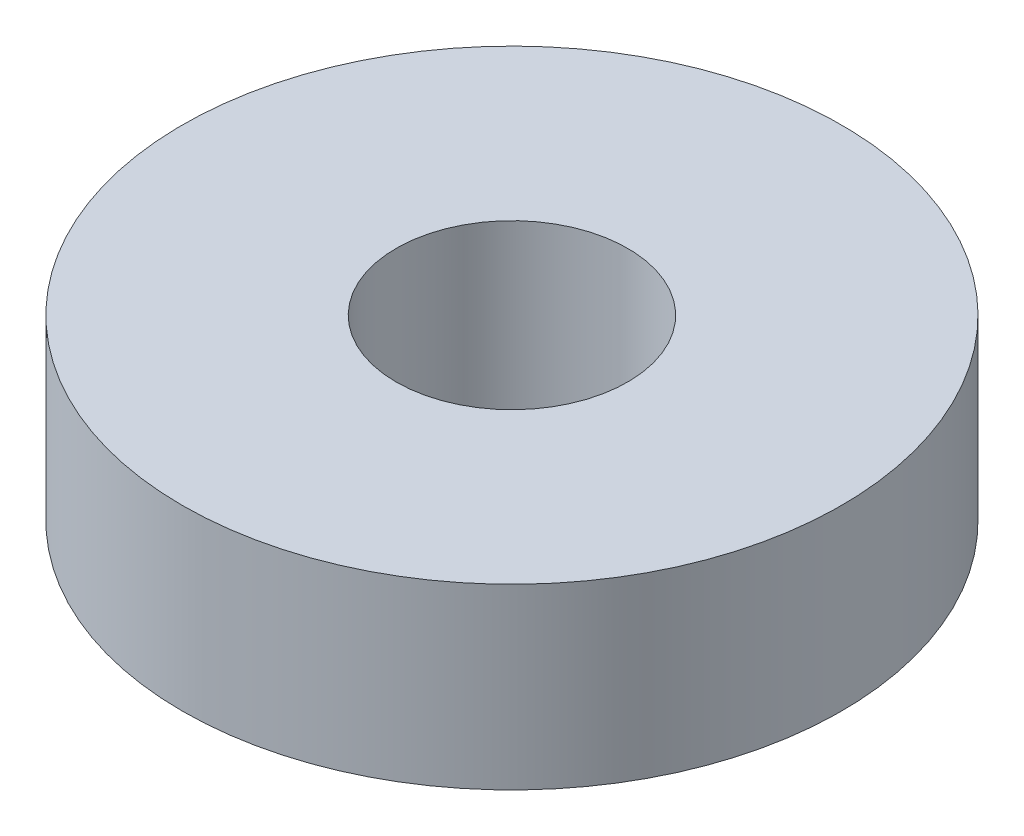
ISO-10303-21;
HEADER;
FILE_DESCRIPTION(('STEP AP214'),'2;1');
FILE_NAME('part.step','',(''),(''),'','','');
FILE_SCHEMA(('AUTOMOTIVE_DESIGN { 1 0 10303 214 1 1 1 1 }'));
ENDSEC;
DATA;
#1=APPLICATION_CONTEXT('core data for automotive mechanical design processes');
#2=APPLICATION_PROTOCOL_DEFINITION('international standard','automotive_design',2000,#1);
#3=PRODUCT_CONTEXT('',#1,'mechanical');
#4=PRODUCT('Part','Part','',(#3));
#5=PRODUCT_RELATED_PRODUCT_CATEGORY('part','',(#4));
#6=PRODUCT_DEFINITION_FORMATION('','',#4);
#7=PRODUCT_DEFINITION_CONTEXT('part definition',#1,'design');
#8=PRODUCT_DEFINITION('design','',#6,#7);
#9=PRODUCT_DEFINITION_SHAPE('','',#8);
#10=(LENGTH_UNIT() NAMED_UNIT(*) SI_UNIT(.MILLI.,.METRE.));
#11=(NAMED_UNIT(*) PLANE_ANGLE_UNIT() SI_UNIT($,.RADIAN.));
#12=(NAMED_UNIT(*) SI_UNIT($,.STERADIAN.) SOLID_ANGLE_UNIT());
#13=UNCERTAINTY_MEASURE_WITH_UNIT(LENGTH_MEASURE(1.E-05),#10,'distance_accuracy_value','');
#14=(GEOMETRIC_REPRESENTATION_CONTEXT(3) GLOBAL_UNCERTAINTY_ASSIGNED_CONTEXT((#13)) GLOBAL_UNIT_ASSIGNED_CONTEXT((#10,
#11,#12)) REPRESENTATION_CONTEXT('',''));
#15=CARTESIAN_POINT('',(0.,0.,0.));
#16=DIRECTION('',(0.,0.,1.));
#17=DIRECTION('',(1.,0.,0.));
#18=AXIS2_PLACEMENT_3D('',#15,#16,#17);
#19=CARTESIAN_POINT('',(0.,5.08,0.));
#20=DIRECTION('',(0.,1.,0.));
#21=DIRECTION('',(0.,0.,1.));
#22=AXIS2_PLACEMENT_3D('',#19,#20,#21);
#23=PLANE('',#22);
#24=CARTESIAN_POINT('',(0.,5.08,0.));
#25=DIRECTION('',(0.,1.,0.));
#26=DIRECTION('',(0.,0.,1.));
#27=AXIS2_PLACEMENT_3D('',#24,#25,#26);
#28=CIRCLE('',#27,9.398);
#29=CARTESIAN_POINT('',(0.,5.08,9.398));
#30=VERTEX_POINT('',#29);
#31=EDGE_CURVE('E10',#30,#30,#28,.T.);
#32=ORIENTED_EDGE('',*,*,#31,.T.);
#33=EDGE_LOOP('',(#32));
#34=FACE_BOUND('',#33,.T.);
#35=CARTESIAN_POINT('',(0.,5.08,0.));
#36=DIRECTION('',(0.,1.,0.));
#37=DIRECTION('',(0.,0.,1.));
#38=AXIS2_PLACEMENT_3D('',#35,#36,#37);
#39=CIRCLE('',#38,3.302);
#40=CARTESIAN_POINT('',(0.,5.08,3.302));
#41=VERTEX_POINT('',#40);
#42=EDGE_CURVE('E42',#41,#41,#39,.T.);
#43=ORIENTED_EDGE('',*,*,#42,.F.);
#44=EDGE_LOOP('',(#43));
#45=FACE_BOUND('',#44,.T.);
#46=ADVANCED_FACE('F31',(#34,#45),#23,.T.);
#47=CARTESIAN_POINT('',(0.,0.,0.));
#48=DIRECTION('',(0.,1.,0.));
#49=DIRECTION('',(0.,0.,1.));
#50=AXIS2_PLACEMENT_3D('',#47,#48,#49);
#51=PLANE('',#50);
#52=CARTESIAN_POINT('',(0.,0.,0.));
#53=DIRECTION('',(0.,1.,0.));
#54=DIRECTION('',(0.,0.,1.));
#55=AXIS2_PLACEMENT_3D('',#52,#53,#54);
#56=CIRCLE('',#55,9.398);
#57=CARTESIAN_POINT('',(0.,0.,9.398));
#58=VERTEX_POINT('',#57);
#59=EDGE_CURVE('E35',#58,#58,#56,.T.);
#60=ORIENTED_EDGE('',*,*,#59,.F.);
#61=EDGE_LOOP('',(#60));
#62=FACE_BOUND('',#61,.T.);
#63=CARTESIAN_POINT('',(0.,0.,0.));
#64=DIRECTION('',(0.,1.,0.));
#65=DIRECTION('',(0.,0.,1.));
#66=AXIS2_PLACEMENT_3D('',#63,#64,#65);
#67=CIRCLE('',#66,3.302);
#68=CARTESIAN_POINT('',(0.,0.,3.302));
#69=VERTEX_POINT('',#68);
#70=EDGE_CURVE('E44',#69,#69,#67,.T.);
#71=ORIENTED_EDGE('',*,*,#70,.T.);
#72=EDGE_LOOP('',(#71));
#73=FACE_BOUND('',#72,.T.);
#74=ADVANCED_FACE('F54',(#62,#73),#51,.F.);
#75=CARTESIAN_POINT('',(0.,5.08,0.));
#76=DIRECTION('',(0.,-1.,0.));
#77=DIRECTION('',(0.,0.,-1.));
#78=AXIS2_PLACEMENT_3D('',#75,#76,#77);
#79=CYLINDRICAL_SURFACE('',#78,9.398);
#80=ORIENTED_EDGE('',*,*,#31,.F.);
#81=EDGE_LOOP('',(#80));
#82=FACE_BOUND('',#81,.T.);
#83=ORIENTED_EDGE('',*,*,#59,.T.);
#84=EDGE_LOOP('',(#83));
#85=FACE_BOUND('',#84,.T.);
#86=ADVANCED_FACE('F33',(#82,#85),#79,.T.);
#87=CARTESIAN_POINT('',(0.,5.08,0.));
#88=DIRECTION('',(0.,-1.,0.));
#89=DIRECTION('',(0.,0.,-1.));
#90=AXIS2_PLACEMENT_3D('',#87,#88,#89);
#91=CYLINDRICAL_SURFACE('',#90,3.302);
#92=ORIENTED_EDGE('',*,*,#42,.T.);
#93=EDGE_LOOP('',(#92));
#94=FACE_BOUND('',#93,.T.);
#95=ORIENTED_EDGE('',*,*,#70,.F.);
#96=EDGE_LOOP('',(#95));
#97=FACE_BOUND('',#96,.T.);
#98=ADVANCED_FACE('F50',(#94,#97),#91,.F.);
#99=CLOSED_SHELL('',(#46,#74,#86,#98));
#100=MANIFOLD_SOLID_BREP('B2',#99);
#101=ADVANCED_BREP_SHAPE_REPRESENTATION('',(#18,#100),#14);
#102=SHAPE_DEFINITION_REPRESENTATION(#9,#101);
ENDSEC;
END-ISO-10303-21;
